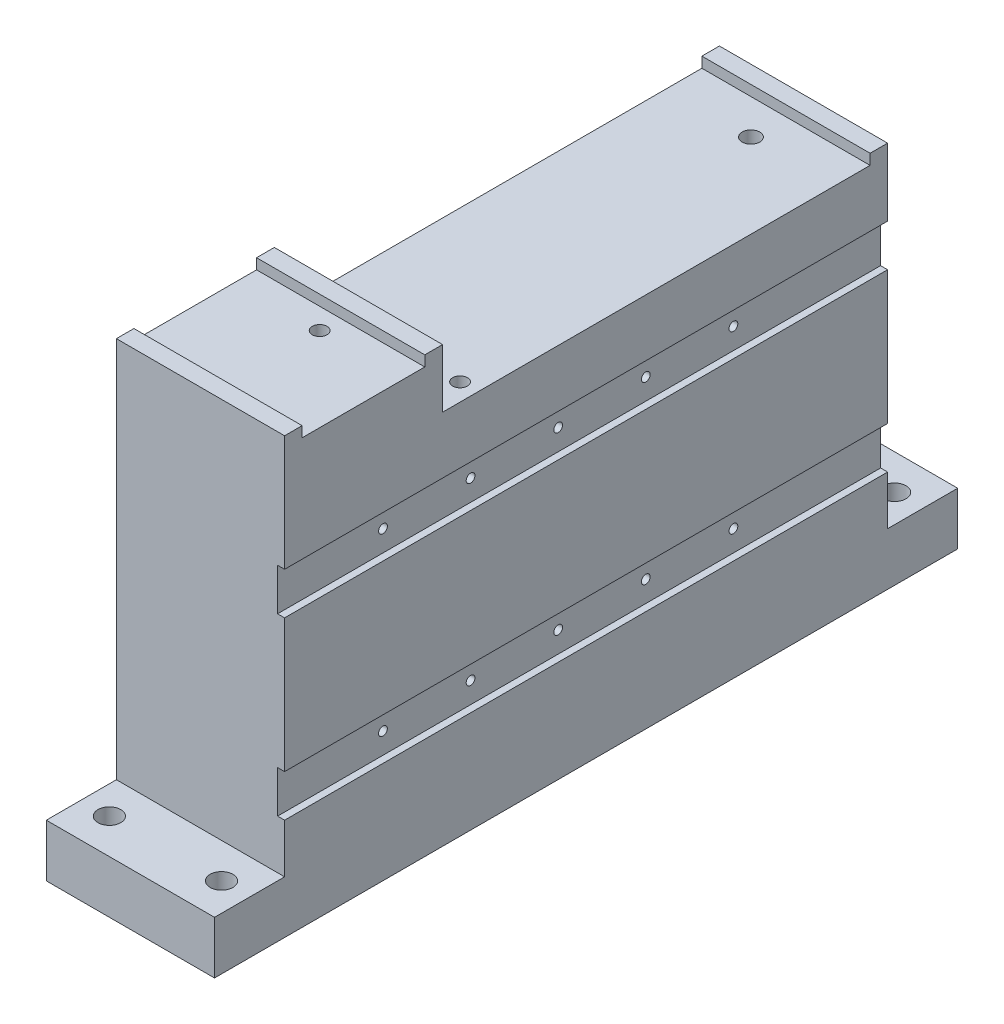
from build123d import *

# Parameters (mm, degrees)
EXTRUDE_1_DEPTH     = 212.0716
SKETCH_2_R          = 3.25
CUT_EXTRUDE_1_DEPTH = 212.0716
SKETCH_3_OUTSIDE_W  = 264.134
SKETCH_3_OUTSIDE_H  = 176.062
SKETCH_3_OUTSIDE_R  = 1.25
CUT_EXTRUDE_2_DEPTH = 212.0716
SKETCH_4_R          = 2.5
SKETCH_4_R_2        = 2.1
CUT_EXTRUDE_3_DEPTH = 15
SKETCH_5_R          = 2.1
CUT_EXTRUDE_4_DEPTH = 15


with BuildPart() as part:
    # Sketch 1 → Extrude 1 (new body)
    with BuildSketch(Plane.XY):
        Polygon((48, 0), (48, 29), (46, 29), (46, 41), (48, 41), (48, 79), (46, 79), (46, 91), (48, 91), (48, 124), (0, 124), (0, 0), align=None)
    extrude(amount=EXTRUDE_1_DEPTH)

    # Sketch 2 → Cut-Extrude 1 (cut)
    with BuildSketch(Plane(origin=(0, 124, 0), x_dir=(1, 0, 0), z_dir=(0, 1, 0))):
        with Locations(Location((8, -202.071630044, 0), (0, 0, 270))):
            Circle(SKETCH_2_R)
        with Locations(Location((40, -202.071630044, 0), (0, 0, 270))):
            Circle(SKETCH_2_R)
        with Locations(Location((40, -10, 0), (0, 0, 270))):
            Circle(SKETCH_2_R)
        with Locations(Location((8, -10, 0), (0, 0, 270))):
            Circle(SKETCH_2_R)
    extrude(amount=-CUT_EXTRUDE_1_DEPTH, mode=Mode.SUBTRACT)

    # Sketch 3 outside → Cut-Extrude 2 (cut)
    # profile 1 of 11: a face of its own
    with BuildSketch(Plane(origin=(48, 0, 0), x_dir=(0, 0, -1), z_dir=(1, 0, 0))):
        with Locations((-106.036, 62)):
            Rectangle(SKETCH_3_OUTSIDE_W, SKETCH_3_OUTSIDE_H)
        Polygon((-147, 107.280000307), (-25, 107.280000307), (-25, 110.280000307), (-20, 110.280000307), (-20, 15), (0, 15), (0, 0), (-212.071629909, 0), (-212.071629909, 15), (-192.071629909, 15), (-192.071629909, 124), (-187.071629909, 124), (-187.071629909, 121), (-152.071629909, 121), (-152.071629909, 124), (-147, 124), align=None, mode=Mode.SUBTRACT)
    # profile 2 of 11: a face of its own
    with BuildSketch(Plane(origin=(48, 0, 0), x_dir=(0, 0, -1), z_dir=(1, 0, 0))):
        with Locations((-62, 35)):
            Circle(SKETCH_3_OUTSIDE_R)
    # profile 3 of 11: a face of its own
    with BuildSketch(Plane(origin=(48, 0, 0), x_dir=(0, 0, -1), z_dir=(1, 0, 0))):
        with Locations((-87, 35)):
            Circle(SKETCH_3_OUTSIDE_R)
    # profile 4 of 11: a face of its own
    with BuildSketch(Plane(origin=(48, 0, 0), x_dir=(0, 0, -1), z_dir=(1, 0, 0))):
        with Locations((-112, 35)):
            Circle(SKETCH_3_OUTSIDE_R)
    # profile 5 of 11: a face of its own
    with BuildSketch(Plane(origin=(48, 0, 0), x_dir=(0, 0, -1), z_dir=(1, 0, 0))):
        with Locations((-137, 35)):
            Circle(SKETCH_3_OUTSIDE_R)
    # profile 6 of 11: a face of its own
    with BuildSketch(Plane(origin=(48, 0, 0), x_dir=(0, 0, -1), z_dir=(1, 0, 0))):
        with Locations((-162, 35)):
            Circle(SKETCH_3_OUTSIDE_R)
    # profile 7 of 11: a face of its own
    with BuildSketch(Plane(origin=(48, 0, 0), x_dir=(0, 0, -1), z_dir=(1, 0, 0))):
        with Locations((-162, 85)):
            Circle(SKETCH_3_OUTSIDE_R)
    # profile 8 of 11: a face of its own
    with BuildSketch(Plane(origin=(48, 0, 0), x_dir=(0, 0, -1), z_dir=(1, 0, 0))):
        with Locations((-137, 85)):
            Circle(SKETCH_3_OUTSIDE_R)
    # profile 9 of 11: a face of its own
    with BuildSketch(Plane(origin=(48, 0, 0), x_dir=(0, 0, -1), z_dir=(1, 0, 0))):
        with Locations((-112, 85)):
            Circle(SKETCH_3_OUTSIDE_R)
    # profile 10 of 11: a face of its own
    with BuildSketch(Plane(origin=(48, 0, 0), x_dir=(0, 0, -1), z_dir=(1, 0, 0))):
        with Locations((-87, 85)):
            Circle(SKETCH_3_OUTSIDE_R)
    # profile 11 of 11: a face of its own
    with BuildSketch(Plane(origin=(48, 0, 0), x_dir=(0, 0, -1), z_dir=(1, 0, 0))):
        with Locations((-62, 85)):
            Circle(SKETCH_3_OUTSIDE_R)
    extrude(amount=-CUT_EXTRUDE_2_DEPTH, mode=Mode.SUBTRACT)

    # Sketch 4 → Cut-Extrude 3 (cut)
    with BuildSketch(Plane(origin=(0, 107.280000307, 0), x_dir=(1, 0, 0), z_dir=(0, 1, 0))):
        with Locations(Location((24, -35, 0), (0, 0, 270))):
            Circle(SKETCH_4_R)
        with Locations(Location((5, -137, 0), (0, 0, 270))):
            Circle(SKETCH_4_R_2)
        with Locations(Location((43, -137, 0), (0, 0, 270))):
            Circle(SKETCH_4_R_2)
    extrude(amount=-CUT_EXTRUDE_3_DEPTH, mode=Mode.SUBTRACT)

    # Sketch 5 → Cut-Extrude 4 (cut)
    with BuildSketch(Plane(origin=(0, 121, 0), x_dir=(1, 0, 0), z_dir=(0, 1, 0))):
        with Locations(Location((24, -158.071630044, 0), (0, 0, 270))):
            Circle(SKETCH_5_R)
    extrude(amount=-CUT_EXTRUDE_4_DEPTH, mode=Mode.SUBTRACT)


solid = part.part
